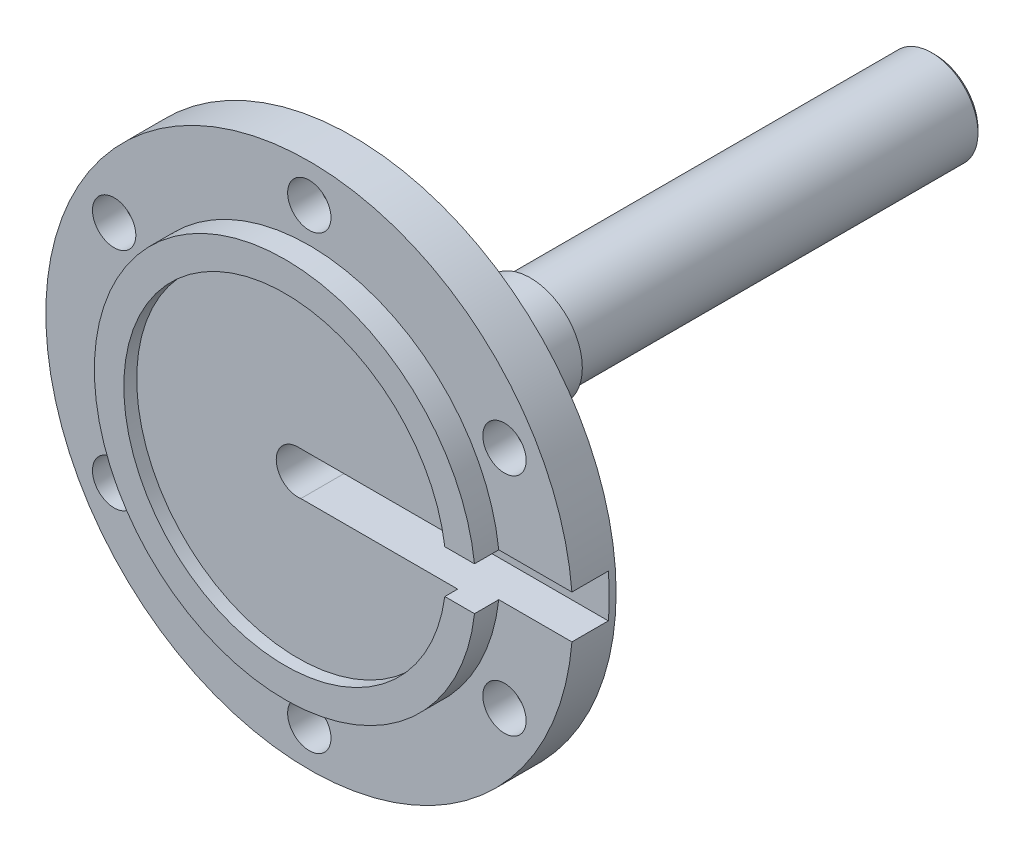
ISO-10303-21;
HEADER;
FILE_DESCRIPTION(('STEP AP214'),'2;1');
FILE_NAME('part.step','',(''),(''),'','','');
FILE_SCHEMA(('AUTOMOTIVE_DESIGN { 1 0 10303 214 1 1 1 1 }'));
ENDSEC;
DATA;
#1=APPLICATION_CONTEXT('core data for automotive mechanical design processes');
#2=APPLICATION_PROTOCOL_DEFINITION('international standard','automotive_design',2000,#1);
#3=PRODUCT_CONTEXT('',#1,'mechanical');
#4=PRODUCT('Part','Part','',(#3));
#5=PRODUCT_RELATED_PRODUCT_CATEGORY('part','',(#4));
#6=PRODUCT_DEFINITION_FORMATION('','',#4);
#7=PRODUCT_DEFINITION_CONTEXT('part definition',#1,'design');
#8=PRODUCT_DEFINITION('design','',#6,#7);
#9=PRODUCT_DEFINITION_SHAPE('','',#8);
#10=(LENGTH_UNIT() NAMED_UNIT(*) SI_UNIT(.MILLI.,.METRE.));
#11=(NAMED_UNIT(*) PLANE_ANGLE_UNIT() SI_UNIT($,.RADIAN.));
#12=(NAMED_UNIT(*) SI_UNIT($,.STERADIAN.) SOLID_ANGLE_UNIT());
#13=UNCERTAINTY_MEASURE_WITH_UNIT(LENGTH_MEASURE(1.E-05),#10,'distance_accuracy_value','');
#14=(GEOMETRIC_REPRESENTATION_CONTEXT(3) GLOBAL_UNCERTAINTY_ASSIGNED_CONTEXT((#13)) GLOBAL_UNIT_ASSIGNED_CONTEXT((#10,
#11,#12)) REPRESENTATION_CONTEXT('',''));
#15=CARTESIAN_POINT('',(0.,0.,0.));
#16=DIRECTION('',(0.,0.,1.));
#17=DIRECTION('',(1.,0.,0.));
#18=AXIS2_PLACEMENT_3D('',#15,#16,#17);
#19=CARTESIAN_POINT('',(0.,0.,6.41744805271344));
#20=DIRECTION('',(0.,0.,1.));
#21=DIRECTION('',(1.,0.,0.));
#22=AXIS2_PLACEMENT_3D('',#19,#20,#21);
#23=CYLINDRICAL_SURFACE('',#22,2.5);
#24=CARTESIAN_POINT('',(0.,0.,-75.));
#25=DIRECTION('',(0.,0.,1.));
#26=DIRECTION('',(1.,0.,0.));
#27=AXIS2_PLACEMENT_3D('',#24,#25,#26);
#28=CIRCLE('',#27,2.5);
#29=CARTESIAN_POINT('',(2.5,0.,-75.));
#30=VERTEX_POINT('',#29);
#31=EDGE_CURVE('E474',#30,#30,#28,.T.);
#32=ORIENTED_EDGE('',*,*,#31,.F.);
#33=EDGE_LOOP('',(#32));
#34=FACE_BOUND('',#33,.T.);
#35=DIRECTION('',(0.,0.,1.));
#36=VECTOR('',#35,1.);
#37=CARTESIAN_POINT('',(0.,2.5,-7.));
#38=LINE('',#37,#36);
#39=CARTESIAN_POINT('',(0.,2.5,-7.));
#40=VERTEX_POINT('',#39);
#41=CARTESIAN_POINT('',(0.,2.5,-1.48606199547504));
#42=VERTEX_POINT('',#41);
#43=EDGE_CURVE('E427',#40,#42,#38,.T.);
#44=ORIENTED_EDGE('',*,*,#43,.T.);
#45=CARTESIAN_POINT('',(0.,0.,-1.48606199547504));
#46=DIRECTION('',(0.,0.,1.));
#47=DIRECTION('',(1.,0.,0.));
#48=AXIS2_PLACEMENT_3D('',#45,#46,#47);
#49=CIRCLE('',#48,2.5);
#50=CARTESIAN_POINT('',(0.338064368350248,-2.47703703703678,-1.48606199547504));
#51=VERTEX_POINT('',#50);
#52=EDGE_CURVE('E477',#42,#51,#49,.T.);
#53=ORIENTED_EDGE('',*,*,#52,.T.);
#54=DIRECTION('',(0.,0.,1.));
#55=VECTOR('',#54,1.);
#56=CARTESIAN_POINT('',(0.338064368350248,-2.47703703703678,6.41744805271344));
#57=LINE('',#56,#55);
#58=CARTESIAN_POINT('',(0.338064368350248,-2.47703703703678,-7.));
#59=VERTEX_POINT('',#58);
#60=EDGE_CURVE('E439',#51,#59,#57,.F.);
#61=ORIENTED_EDGE('',*,*,#60,.T.);
#62=CARTESIAN_POINT('',(0.,0.,-7.));
#63=DIRECTION('',(0.,0.,1.));
#64=DIRECTION('',(1.,0.,0.));
#65=AXIS2_PLACEMENT_3D('',#62,#63,#64);
#66=CIRCLE('',#65,2.5);
#67=EDGE_CURVE('E422',#40,#59,#66,.F.);
#68=ORIENTED_EDGE('',*,*,#67,.F.);
#69=EDGE_LOOP('',(#44,#53,#61,#68));
#70=FACE_BOUND('',#69,.T.);
#71=ADVANCED_FACE('F353',(#34,#70),#23,.F.);
#72=CARTESIAN_POINT('',(0.,0.,6.41744805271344));
#73=DIRECTION('',(0.,0.,1.));
#74=DIRECTION('',(1.,0.,0.));
#75=AXIS2_PLACEMENT_3D('',#72,#73,#74);
#76=CYLINDRICAL_SURFACE('',#75,22.);
#77=CARTESIAN_POINT('',(0.,0.,0.));
#78=DIRECTION('',(0.,0.,1.));
#79=DIRECTION('',(1.,0.,0.));
#80=AXIS2_PLACEMENT_3D('',#77,#78,#79);
#81=CIRCLE('',#80,22.);
#82=CARTESIAN_POINT('',(21.8574929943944,2.5,0.));
#83=VERTEX_POINT('',#82);
#84=CARTESIAN_POINT('',(21.8601072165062,-2.47703703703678,0.));
#85=VERTEX_POINT('',#84);
#86=EDGE_CURVE('E485',#83,#85,#81,.T.);
#87=ORIENTED_EDGE('',*,*,#86,.F.);
#88=DIRECTION('',(0.,0.,1.));
#89=VECTOR('',#88,1.);
#90=CARTESIAN_POINT('',(21.8574929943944,2.5,6.41744805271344));
#91=LINE('',#90,#89);
#92=CARTESIAN_POINT('',(21.8574929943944,2.5,-2.8));
#93=VERTEX_POINT('',#92);
#94=EDGE_CURVE('E552',#83,#93,#91,.F.);
#95=ORIENTED_EDGE('',*,*,#94,.T.);
#96=CARTESIAN_POINT('',(0.,0.,-2.8));
#97=DIRECTION('',(0.,0.,1.));
#98=DIRECTION('',(1.,0.,0.));
#99=AXIS2_PLACEMENT_3D('',#96,#97,#98);
#100=CIRCLE('',#99,22.);
#101=CARTESIAN_POINT('',(21.8601072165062,-2.47703703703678,-2.8));
#102=VERTEX_POINT('',#101);
#103=EDGE_CURVE('E440',#93,#102,#100,.T.);
#104=ORIENTED_EDGE('',*,*,#103,.T.);
#105=DIRECTION('',(0.,0.,1.));
#106=VECTOR('',#105,1.);
#107=CARTESIAN_POINT('',(21.8601072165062,-2.47703703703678,6.41744805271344));
#108=LINE('',#107,#106);
#109=EDGE_CURVE('E368',#102,#85,#108,.T.);
#110=ORIENTED_EDGE('',*,*,#109,.T.);
#111=EDGE_LOOP('',(#87,#95,#104,#110));
#112=FACE_BOUND('',#111,.T.);
#113=ADVANCED_FACE('F355',(#112),#76,.T.);
#114=CARTESIAN_POINT('',(0.,22.,0.));
#115=DIRECTION('',(0.,0.,-1.));
#116=DIRECTION('',(-1.,0.,0.));
#117=AXIS2_PLACEMENT_3D('',#114,#115,#116);
#118=PLANE('',#117);
#119=CARTESIAN_POINT('',(0.,0.,0.));
#120=DIRECTION('',(0.,0.,1.));
#121=DIRECTION('',(1.,0.,0.));
#122=AXIS2_PLACEMENT_3D('',#119,#120,#121);
#123=CIRCLE('',#122,18.6);
#124=CARTESIAN_POINT('',(18.4312235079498,2.5,0.));
#125=VERTEX_POINT('',#124);
#126=CARTESIAN_POINT('',(18.4343236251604,-2.47703703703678,0.));
#127=VERTEX_POINT('',#126);
#128=EDGE_CURVE('E482',#125,#127,#123,.T.);
#129=ORIENTED_EDGE('',*,*,#128,.F.);
#130=DIRECTION('',(-1.,0.,0.));
#131=VECTOR('',#130,1.);
#132=CARTESIAN_POINT('',(0.,2.5,0.));
#133=LINE('',#132,#131);
#134=EDGE_CURVE('E544',#83,#125,#133,.T.);
#135=ORIENTED_EDGE('',*,*,#134,.F.);
#136=ORIENTED_EDGE('',*,*,#86,.T.);
#137=DIRECTION('',(1.,0.,0.));
#138=VECTOR('',#137,1.);
#139=CARTESIAN_POINT('',(0.,-2.47703703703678,0.));
#140=LINE('',#139,#138);
#141=EDGE_CURVE('E546',#127,#85,#140,.T.);
#142=ORIENTED_EDGE('',*,*,#141,.F.);
#143=EDGE_LOOP('',(#129,#135,#136,#142));
#144=FACE_BOUND('',#143,.T.);
#145=ADVANCED_FACE('F523',(#144),#118,.F.);
#146=CARTESIAN_POINT('',(0.,0.,6.41744805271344));
#147=DIRECTION('',(0.,0.,1.));
#148=DIRECTION('',(1.,0.,0.));
#149=AXIS2_PLACEMENT_3D('',#146,#147,#148);
#150=CYLINDRICAL_SURFACE('',#149,18.6);
#151=CARTESIAN_POINT('',(0.,0.,-1.48606199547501));
#152=DIRECTION('',(0.,0.,1.));
#153=DIRECTION('',(1.,0.,0.));
#154=AXIS2_PLACEMENT_3D('',#151,#152,#153);
#155=CIRCLE('',#154,18.6);
#156=CARTESIAN_POINT('',(18.4312235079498,2.5,-1.48606199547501));
#157=VERTEX_POINT('',#156);
#158=CARTESIAN_POINT('',(18.4343236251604,-2.47703703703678,-1.48606199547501));
#159=VERTEX_POINT('',#158);
#160=EDGE_CURVE('E479',#157,#159,#155,.T.);
#161=ORIENTED_EDGE('',*,*,#160,.F.);
#162=DIRECTION('',(0.,0.,1.));
#163=VECTOR('',#162,1.);
#164=CARTESIAN_POINT('',(18.4312235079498,2.5,6.41744805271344));
#165=LINE('',#164,#163);
#166=EDGE_CURVE('E376',#157,#125,#165,.T.);
#167=ORIENTED_EDGE('',*,*,#166,.T.);
#168=ORIENTED_EDGE('',*,*,#128,.T.);
#169=DIRECTION('',(0.,0.,1.));
#170=VECTOR('',#169,1.);
#171=CARTESIAN_POINT('',(18.4343236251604,-2.47703703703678,6.41744805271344));
#172=LINE('',#171,#170);
#173=EDGE_CURVE('E549',#127,#159,#172,.F.);
#174=ORIENTED_EDGE('',*,*,#173,.T.);
#175=EDGE_LOOP('',(#161,#167,#168,#174));
#176=FACE_BOUND('',#175,.T.);
#177=ADVANCED_FACE('F533',(#176),#150,.F.);
#178=CARTESIAN_POINT('',(0.,18.6,-1.48606199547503));
#179=DIRECTION('',(0.,0.,-1.));
#180=DIRECTION('',(-1.,0.,0.));
#181=AXIS2_PLACEMENT_3D('',#178,#179,#180);
#182=PLANE('',#181);
#183=ORIENTED_EDGE('',*,*,#52,.F.);
#184=DIRECTION('',(1.,0.,0.));
#185=VECTOR('',#184,1.);
#186=CARTESIAN_POINT('',(0.,2.5,-1.48606199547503));
#187=LINE('',#186,#185);
#188=EDGE_CURVE('E432',#42,#157,#187,.T.);
#189=ORIENTED_EDGE('',*,*,#188,.T.);
#190=ORIENTED_EDGE('',*,*,#160,.T.);
#191=DIRECTION('',(-1.,0.,0.));
#192=VECTOR('',#191,1.);
#193=CARTESIAN_POINT('',(0.,-2.47703703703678,-1.48606199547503));
#194=LINE('',#193,#192);
#195=EDGE_CURVE('E551',#159,#51,#194,.T.);
#196=ORIENTED_EDGE('',*,*,#195,.T.);
#197=EDGE_LOOP('',(#183,#189,#190,#196));
#198=FACE_BOUND('',#197,.T.);
#199=ADVANCED_FACE('F530',(#198),#182,.F.);
#200=CARTESIAN_POINT('',(0.,5.35,-75.));
#201=DIRECTION('',(0.,0.,1.));
#202=DIRECTION('',(1.,0.,0.));
#203=AXIS2_PLACEMENT_3D('',#200,#201,#202);
#204=PLANE('',#203);
#205=CARTESIAN_POINT('',(0.,0.,-75.));
#206=DIRECTION('',(0.,0.,1.));
#207=DIRECTION('',(1.,0.,0.));
#208=AXIS2_PLACEMENT_3D('',#205,#206,#207);
#209=CIRCLE('',#208,4.95000000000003);
#210=CARTESIAN_POINT('',(4.95000000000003,0.,-75.));
#211=VERTEX_POINT('',#210);
#212=EDGE_CURVE('E11',#211,#211,#209,.F.);
#213=ORIENTED_EDGE('',*,*,#212,.T.);
#214=EDGE_LOOP('',(#213));
#215=FACE_BOUND('',#214,.T.);
#216=ORIENTED_EDGE('',*,*,#31,.T.);
#217=EDGE_LOOP('',(#216));
#218=FACE_BOUND('',#217,.T.);
#219=ADVANCED_FACE('F528',(#215,#218),#204,.F.);
#220=CARTESIAN_POINT('',(0.,0.,6.41744805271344));
#221=DIRECTION('',(0.,0.,1.));
#222=DIRECTION('',(1.,0.,0.));
#223=AXIS2_PLACEMENT_3D('',#220,#221,#222);
#224=CYLINDRICAL_SURFACE('',#223,5.35);
#225=CARTESIAN_POINT('',(0.,0.,-74.6));
#226=DIRECTION('',(0.,0.,1.));
#227=DIRECTION('',(1.,0.,0.));
#228=AXIS2_PLACEMENT_3D('',#225,#226,#227);
#229=CIRCLE('',#228,5.35);
#230=CARTESIAN_POINT('',(5.35,0.,-74.6));
#231=VERTEX_POINT('',#230);
#232=EDGE_CURVE('E361',#231,#231,#229,.T.);
#233=ORIENTED_EDGE('',*,*,#232,.T.);
#234=EDGE_LOOP('',(#233));
#235=FACE_BOUND('',#234,.T.);
#236=CARTESIAN_POINT('',(0.,0.,-28.3));
#237=DIRECTION('',(0.,0.,1.));
#238=DIRECTION('',(1.,0.,0.));
#239=AXIS2_PLACEMENT_3D('',#236,#237,#238);
#240=CIRCLE('',#239,5.35);
#241=CARTESIAN_POINT('',(5.35,0.,-28.3));
#242=VERTEX_POINT('',#241);
#243=EDGE_CURVE('E471',#242,#242,#240,.T.);
#244=ORIENTED_EDGE('',*,*,#243,.F.);
#245=EDGE_LOOP('',(#244));
#246=FACE_BOUND('',#245,.T.);
#247=ADVANCED_FACE('F496',(#235,#246),#224,.T.);
#248=CARTESIAN_POINT('',(0.,6.,-28.3));
#249=DIRECTION('',(0.,0.,1.));
#250=DIRECTION('',(1.,0.,0.));
#251=AXIS2_PLACEMENT_3D('',#248,#249,#250);
#252=PLANE('',#251);
#253=CARTESIAN_POINT('',(0.,0.,-28.3));
#254=DIRECTION('',(0.,0.,1.));
#255=DIRECTION('',(1.,0.,0.));
#256=AXIS2_PLACEMENT_3D('',#253,#254,#255);
#257=CIRCLE('',#256,6.);
#258=CARTESIAN_POINT('',(6.,0.,-28.3));
#259=VERTEX_POINT('',#258);
#260=EDGE_CURVE('E468',#259,#259,#257,.T.);
#261=ORIENTED_EDGE('',*,*,#260,.F.);
#262=EDGE_LOOP('',(#261));
#263=FACE_BOUND('',#262,.T.);
#264=ORIENTED_EDGE('',*,*,#243,.T.);
#265=EDGE_LOOP('',(#264));
#266=FACE_BOUND('',#265,.T.);
#267=ADVANCED_FACE('F677',(#263,#266),#252,.F.);
#268=CARTESIAN_POINT('',(0.,0.,6.41744805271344));
#269=DIRECTION('',(0.,0.,1.));
#270=DIRECTION('',(1.,0.,0.));
#271=AXIS2_PLACEMENT_3D('',#268,#269,#270);
#272=CYLINDRICAL_SURFACE('',#271,6.);
#273=CARTESIAN_POINT('',(0.,0.,-20.5));
#274=DIRECTION('',(0.,0.,1.));
#275=DIRECTION('',(1.,0.,0.));
#276=AXIS2_PLACEMENT_3D('',#273,#274,#275);
#277=CIRCLE('',#276,6.);
#278=CARTESIAN_POINT('',(6.,0.,-20.5));
#279=VERTEX_POINT('',#278);
#280=EDGE_CURVE('E465',#279,#279,#277,.T.);
#281=ORIENTED_EDGE('',*,*,#280,.F.);
#282=EDGE_LOOP('',(#281));
#283=FACE_BOUND('',#282,.T.);
#284=ORIENTED_EDGE('',*,*,#260,.T.);
#285=EDGE_LOOP('',(#284));
#286=FACE_BOUND('',#285,.T.);
#287=ADVANCED_FACE('F671',(#283,#286),#272,.T.);
#288=CARTESIAN_POINT('',(0.,9.,-20.5));
#289=DIRECTION('',(0.,0.,1.));
#290=DIRECTION('',(1.,0.,0.));
#291=AXIS2_PLACEMENT_3D('',#288,#289,#290);
#292=PLANE('',#291);
#293=CARTESIAN_POINT('',(0.,0.,-20.5));
#294=DIRECTION('',(0.,0.,1.));
#295=DIRECTION('',(1.,0.,0.));
#296=AXIS2_PLACEMENT_3D('',#293,#294,#295);
#297=CIRCLE('',#296,9.);
#298=CARTESIAN_POINT('',(9.,0.,-20.5));
#299=VERTEX_POINT('',#298);
#300=EDGE_CURVE('E462',#299,#299,#297,.T.);
#301=ORIENTED_EDGE('',*,*,#300,.F.);
#302=EDGE_LOOP('',(#301));
#303=FACE_BOUND('',#302,.T.);
#304=ORIENTED_EDGE('',*,*,#280,.T.);
#305=EDGE_LOOP('',(#304));
#306=FACE_BOUND('',#305,.T.);
#307=ADVANCED_FACE('F665',(#303,#306),#292,.F.);
#308=CARTESIAN_POINT('',(0.,0.,6.41744805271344));
#309=DIRECTION('',(0.,0.,1.));
#310=DIRECTION('',(1.,0.,0.));
#311=AXIS2_PLACEMENT_3D('',#308,#309,#310);
#312=CYLINDRICAL_SURFACE('',#311,9.);
#313=CARTESIAN_POINT('',(0.,0.,-10.5));
#314=DIRECTION('',(0.,0.,1.));
#315=DIRECTION('',(1.,0.,0.));
#316=AXIS2_PLACEMENT_3D('',#313,#314,#315);
#317=CIRCLE('',#316,9.);
#318=CARTESIAN_POINT('',(9.,0.,-10.5));
#319=VERTEX_POINT('',#318);
#320=EDGE_CURVE('E459',#319,#319,#317,.T.);
#321=ORIENTED_EDGE('',*,*,#320,.F.);
#322=EDGE_LOOP('',(#321));
#323=FACE_BOUND('',#322,.T.);
#324=ORIENTED_EDGE('',*,*,#300,.T.);
#325=EDGE_LOOP('',(#324));
#326=FACE_BOUND('',#325,.T.);
#327=ADVANCED_FACE('F659',(#323,#326),#312,.T.);
#328=CARTESIAN_POINT('',(0.,11.4,-10.5));
#329=DIRECTION('',(0.,0.,1.));
#330=DIRECTION('',(1.,0.,0.));
#331=AXIS2_PLACEMENT_3D('',#328,#329,#330);
#332=PLANE('',#331);
#333=CARTESIAN_POINT('',(0.,0.,-10.5));
#334=DIRECTION('',(0.,0.,1.));
#335=DIRECTION('',(1.,0.,0.));
#336=AXIS2_PLACEMENT_3D('',#333,#334,#335);
#337=CIRCLE('',#336,11.4);
#338=CARTESIAN_POINT('',(11.4,0.,-10.5));
#339=VERTEX_POINT('',#338);
#340=EDGE_CURVE('E456',#339,#339,#337,.T.);
#341=ORIENTED_EDGE('',*,*,#340,.F.);
#342=EDGE_LOOP('',(#341));
#343=FACE_BOUND('',#342,.T.);
#344=ORIENTED_EDGE('',*,*,#320,.T.);
#345=EDGE_LOOP('',(#344));
#346=FACE_BOUND('',#345,.T.);
#347=ADVANCED_FACE('F653',(#343,#346),#332,.F.);
#348=CARTESIAN_POINT('',(0.,0.,6.41744805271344));
#349=DIRECTION('',(0.,0.,1.));
#350=DIRECTION('',(1.,0.,0.));
#351=AXIS2_PLACEMENT_3D('',#348,#349,#350);
#352=CYLINDRICAL_SURFACE('',#351,11.4);
#353=CARTESIAN_POINT('',(0.,0.,-7.8));
#354=DIRECTION('',(0.,0.,1.));
#355=DIRECTION('',(1.,0.,0.));
#356=AXIS2_PLACEMENT_3D('',#353,#354,#355);
#357=CIRCLE('',#356,11.4);
#358=CARTESIAN_POINT('',(11.4,0.,-7.8));
#359=VERTEX_POINT('',#358);
#360=EDGE_CURVE('E453',#359,#359,#357,.T.);
#361=ORIENTED_EDGE('',*,*,#360,.F.);
#362=EDGE_LOOP('',(#361));
#363=FACE_BOUND('',#362,.T.);
#364=ORIENTED_EDGE('',*,*,#340,.T.);
#365=EDGE_LOOP('',(#364));
#366=FACE_BOUND('',#365,.T.);
#367=ADVANCED_FACE('F636',(#363,#366),#352,.T.);
#368=CARTESIAN_POINT('',(0.,30.4,-7.8));
#369=DIRECTION('',(0.,0.,1.));
#370=DIRECTION('',(1.,0.,0.));
#371=AXIS2_PLACEMENT_3D('',#368,#369,#370);
#372=PLANE('',#371);
#373=CARTESIAN_POINT('',(-22.5166604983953,13.0000000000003,-7.8));
#374=DIRECTION('',(0.,0.,-1.));
#375=DIRECTION('',(-0.50000000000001,-0.866025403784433,0.));
#376=AXIS2_PLACEMENT_3D('',#373,#374,#375);
#377=CIRCLE('',#376,4.);
#378=CARTESIAN_POINT('',(-24.5166604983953,9.53589838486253,-7.8));
#379=VERTEX_POINT('',#378);
#380=EDGE_CURVE('E615',#379,#379,#377,.T.);
#381=ORIENTED_EDGE('',*,*,#380,.F.);
#382=EDGE_LOOP('',(#381));
#383=FACE_BOUND('',#382,.T.);
#384=CARTESIAN_POINT('',(-22.5166604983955,-12.9999999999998,-7.8));
#385=DIRECTION('',(0.,0.,-1.));
#386=DIRECTION('',(0.499999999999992,-0.866025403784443,0.));
#387=AXIS2_PLACEMENT_3D('',#384,#385,#386);
#388=CIRCLE('',#387,4.);
#389=CARTESIAN_POINT('',(-20.5166604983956,-16.4641016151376,-7.8));
#390=VERTEX_POINT('',#389);
#391=EDGE_CURVE('E609',#390,#390,#388,.T.);
#392=ORIENTED_EDGE('',*,*,#391,.F.);
#393=EDGE_LOOP('',(#392));
#394=FACE_BOUND('',#393,.T.);
#395=CARTESIAN_POINT('',(-1.81557134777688E-13,-26.,-7.8));
#396=DIRECTION('',(0.,0.,-1.));
#397=DIRECTION('',(1.,0.,0.));
#398=AXIS2_PLACEMENT_3D('',#395,#396,#397);
#399=CIRCLE('',#398,4.);
#400=CARTESIAN_POINT('',(3.99999999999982,-26.,-7.8));
#401=VERTEX_POINT('',#400);
#402=EDGE_CURVE('E603',#401,#401,#399,.T.);
#403=ORIENTED_EDGE('',*,*,#402,.F.);
#404=EDGE_LOOP('',(#403));
#405=FACE_BOUND('',#404,.T.);
#406=CARTESIAN_POINT('',(22.5166604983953,-13.0000000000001,-7.8));
#407=DIRECTION('',(0.,0.,-1.));
#408=DIRECTION('',(0.500000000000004,0.866025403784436,0.));
#409=AXIS2_PLACEMENT_3D('',#406,#407,#408);
#410=CIRCLE('',#409,4.);
#411=CARTESIAN_POINT('',(24.5166604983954,-9.53589838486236,-7.8));
#412=VERTEX_POINT('',#411);
#413=EDGE_CURVE('E597',#412,#412,#410,.T.);
#414=ORIENTED_EDGE('',*,*,#413,.F.);
#415=EDGE_LOOP('',(#414));
#416=FACE_BOUND('',#415,.T.);
#417=CARTESIAN_POINT('',(22.5166604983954,12.9999999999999,-7.8));
#418=DIRECTION('',(0.,0.,-1.));
#419=DIRECTION('',(-0.499999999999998,0.86602540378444,0.));
#420=AXIS2_PLACEMENT_3D('',#417,#418,#419);
#421=CIRCLE('',#420,4.);
#422=CARTESIAN_POINT('',(20.5166604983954,16.4641016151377,-7.8));
#423=VERTEX_POINT('',#422);
#424=EDGE_CURVE('E591',#423,#423,#421,.T.);
#425=ORIENTED_EDGE('',*,*,#424,.F.);
#426=EDGE_LOOP('',(#425));
#427=FACE_BOUND('',#426,.T.);
#428=CARTESIAN_POINT('',(0.,26.,-7.8));
#429=DIRECTION('',(0.,0.,-1.));
#430=DIRECTION('',(-1.,0.,0.));
#431=AXIS2_PLACEMENT_3D('',#428,#429,#430);
#432=CIRCLE('',#431,4.);
#433=CARTESIAN_POINT('',(-4.,26.,-7.8));
#434=VERTEX_POINT('',#433);
#435=EDGE_CURVE('E570',#434,#434,#432,.T.);
#436=ORIENTED_EDGE('',*,*,#435,.F.);
#437=EDGE_LOOP('',(#436));
#438=FACE_BOUND('',#437,.T.);
#439=CARTESIAN_POINT('',(0.,0.,-7.8));
#440=DIRECTION('',(0.,0.,1.));
#441=DIRECTION('',(1.,0.,0.));
#442=AXIS2_PLACEMENT_3D('',#439,#440,#441);
#443=CIRCLE('',#442,30.4);
#444=CARTESIAN_POINT('',(30.4,0.,-7.8));
#445=VERTEX_POINT('',#444);
#446=EDGE_CURVE('E450',#445,#445,#443,.T.);
#447=ORIENTED_EDGE('',*,*,#446,.F.);
#448=EDGE_LOOP('',(#447));
#449=FACE_BOUND('',#448,.T.);
#450=ORIENTED_EDGE('',*,*,#360,.T.);
#451=EDGE_LOOP('',(#450));
#452=FACE_BOUND('',#451,.T.);
#453=ADVANCED_FACE('F632',(#383,#394,#405,#416,#427,#438,#449,#452),#372,.F.);
#454=CARTESIAN_POINT('',(0.,0.,6.41744805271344));
#455=DIRECTION('',(0.,0.,1.));
#456=DIRECTION('',(1.,0.,0.));
#457=AXIS2_PLACEMENT_3D('',#454,#455,#456);
#458=CYLINDRICAL_SURFACE('',#457,30.4);
#459=CARTESIAN_POINT('',(0.,0.,-2.8));
#460=DIRECTION('',(0.,0.,1.));
#461=DIRECTION('',(1.,0.,0.));
#462=AXIS2_PLACEMENT_3D('',#459,#460,#461);
#463=CIRCLE('',#462,30.4);
#464=CARTESIAN_POINT('',(30.2970295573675,2.5,-2.8));
#465=VERTEX_POINT('',#464);
#466=CARTESIAN_POINT('',(30.2989156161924,-2.47703703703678,-2.8));
#467=VERTEX_POINT('',#466);
#468=EDGE_CURVE('E443',#465,#467,#463,.T.);
#469=ORIENTED_EDGE('',*,*,#468,.F.);
#470=DIRECTION('',(0.,0.,1.));
#471=VECTOR('',#470,1.);
#472=CARTESIAN_POINT('',(30.2970295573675,2.5,6.41744805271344));
#473=LINE('',#472,#471);
#474=CARTESIAN_POINT('',(30.2970295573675,2.5,-7.));
#475=VERTEX_POINT('',#474);
#476=EDGE_CURVE('E554',#465,#475,#473,.F.);
#477=ORIENTED_EDGE('',*,*,#476,.T.);
#478=CARTESIAN_POINT('',(0.,0.,-7.));
#479=DIRECTION('',(0.,0.,1.));
#480=DIRECTION('',(1.,0.,0.));
#481=AXIS2_PLACEMENT_3D('',#478,#479,#480);
#482=CIRCLE('',#481,30.4);
#483=CARTESIAN_POINT('',(30.2989156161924,-2.47703703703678,-7.));
#484=VERTEX_POINT('',#483);
#485=EDGE_CURVE('E425',#484,#475,#482,.T.);
#486=ORIENTED_EDGE('',*,*,#485,.F.);
#487=DIRECTION('',(0.,0.,1.));
#488=VECTOR('',#487,1.);
#489=CARTESIAN_POINT('',(30.2989156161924,-2.47703703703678,6.41744805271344));
#490=LINE('',#489,#488);
#491=EDGE_CURVE('E436',#484,#467,#490,.T.);
#492=ORIENTED_EDGE('',*,*,#491,.T.);
#493=EDGE_LOOP('',(#469,#477,#486,#492));
#494=FACE_BOUND('',#493,.T.);
#495=ORIENTED_EDGE('',*,*,#446,.T.);
#496=EDGE_LOOP('',(#495));
#497=FACE_BOUND('',#496,.T.);
#498=ADVANCED_FACE('F635',(#494,#497),#458,.T.);
#499=CARTESIAN_POINT('',(0.,22.,-2.8));
#500=DIRECTION('',(0.,0.,-1.));
#501=DIRECTION('',(-1.,0.,0.));
#502=AXIS2_PLACEMENT_3D('',#499,#500,#501);
#503=PLANE('',#502);
#504=CARTESIAN_POINT('',(-22.5166604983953,13.0000000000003,-2.8));
#505=DIRECTION('',(0.,0.,1.));
#506=DIRECTION('',(0.50000000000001,0.866025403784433,0.));
#507=AXIS2_PLACEMENT_3D('',#504,#505,#506);
#508=CIRCLE('',#507,2.5);
#509=CARTESIAN_POINT('',(-21.2666604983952,15.1650635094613,-2.8));
#510=VERTEX_POINT('',#509);
#511=EDGE_CURVE('E588',#510,#510,#508,.T.);
#512=ORIENTED_EDGE('',*,*,#511,.F.);
#513=EDGE_LOOP('',(#512));
#514=FACE_BOUND('',#513,.T.);
#515=CARTESIAN_POINT('',(-22.5166604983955,-12.9999999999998,-2.8));
#516=DIRECTION('',(0.,0.,1.));
#517=DIRECTION('',(-0.499999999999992,0.866025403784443,0.));
#518=AXIS2_PLACEMENT_3D('',#515,#516,#517);
#519=CIRCLE('',#518,2.5);
#520=CARTESIAN_POINT('',(-23.7666604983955,-10.8349364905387,-2.8));
#521=VERTEX_POINT('',#520);
#522=EDGE_CURVE('E585',#521,#521,#519,.T.);
#523=ORIENTED_EDGE('',*,*,#522,.F.);
#524=EDGE_LOOP('',(#523));
#525=FACE_BOUND('',#524,.T.);
#526=CARTESIAN_POINT('',(-1.81557134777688E-13,-26.,-2.8));
#527=DIRECTION('',(0.,0.,1.));
#528=DIRECTION('',(-1.,0.,0.));
#529=AXIS2_PLACEMENT_3D('',#526,#527,#528);
#530=CIRCLE('',#529,2.5);
#531=CARTESIAN_POINT('',(-2.50000000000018,-26.,-2.8));
#532=VERTEX_POINT('',#531);
#533=EDGE_CURVE('E582',#532,#532,#530,.T.);
#534=ORIENTED_EDGE('',*,*,#533,.F.);
#535=EDGE_LOOP('',(#534));
#536=FACE_BOUND('',#535,.T.);
#537=CARTESIAN_POINT('',(22.5166604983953,-13.0000000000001,-2.8));
#538=DIRECTION('',(0.,0.,1.));
#539=DIRECTION('',(-0.500000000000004,-0.866025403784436,0.));
#540=AXIS2_PLACEMENT_3D('',#537,#538,#539);
#541=CIRCLE('',#540,2.5);
#542=CARTESIAN_POINT('',(21.2666604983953,-15.1650635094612,-2.8));
#543=VERTEX_POINT('',#542);
#544=EDGE_CURVE('E579',#543,#543,#541,.T.);
#545=ORIENTED_EDGE('',*,*,#544,.F.);
#546=EDGE_LOOP('',(#545));
#547=FACE_BOUND('',#546,.T.);
#548=CARTESIAN_POINT('',(22.5166604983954,12.9999999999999,-2.8));
#549=DIRECTION('',(0.,0.,1.));
#550=DIRECTION('',(0.499999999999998,-0.86602540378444,0.));
#551=AXIS2_PLACEMENT_3D('',#548,#549,#550);
#552=CIRCLE('',#551,2.5);
#553=CARTESIAN_POINT('',(23.7666604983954,10.8349364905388,-2.8));
#554=VERTEX_POINT('',#553);
#555=EDGE_CURVE('E576',#554,#554,#552,.T.);
#556=ORIENTED_EDGE('',*,*,#555,.F.);
#557=EDGE_LOOP('',(#556));
#558=FACE_BOUND('',#557,.T.);
#559=CARTESIAN_POINT('',(0.,26.,-2.8));
#560=DIRECTION('',(0.,0.,1.));
#561=DIRECTION('',(1.,0.,0.));
#562=AXIS2_PLACEMENT_3D('',#559,#560,#561);
#563=CIRCLE('',#562,2.5);
#564=CARTESIAN_POINT('',(2.5,26.,-2.8));
#565=VERTEX_POINT('',#564);
#566=EDGE_CURVE('E567',#565,#565,#563,.T.);
#567=ORIENTED_EDGE('',*,*,#566,.F.);
#568=EDGE_LOOP('',(#567));
#569=FACE_BOUND('',#568,.T.);
#570=ORIENTED_EDGE('',*,*,#103,.F.);
#571=DIRECTION('',(1.,0.,0.));
#572=VECTOR('',#571,1.);
#573=CARTESIAN_POINT('',(0.,2.5,-2.8));
#574=LINE('',#573,#572);
#575=EDGE_CURVE('E490',#93,#465,#574,.T.);
#576=ORIENTED_EDGE('',*,*,#575,.T.);
#577=ORIENTED_EDGE('',*,*,#468,.T.);
#578=DIRECTION('',(-1.,0.,0.));
#579=VECTOR('',#578,1.);
#580=CARTESIAN_POINT('',(0.,-2.47703703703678,-2.8));
#581=LINE('',#580,#579);
#582=EDGE_CURVE('E488',#467,#102,#581,.T.);
#583=ORIENTED_EDGE('',*,*,#582,.T.);
#584=EDGE_LOOP('',(#570,#576,#577,#583));
#585=FACE_BOUND('',#584,.T.);
#586=ADVANCED_FACE('F692',(#514,#525,#536,#547,#558,#569,#585),#503,.F.);
#587=CARTESIAN_POINT('',(0.,-2.47703703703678,-7.));
#588=DIRECTION('',(0.,0.,1.));
#589=DIRECTION('',(1.,0.,0.));
#590=AXIS2_PLACEMENT_3D('',#587,#588,#589);
#591=PLANE('',#590);
#592=ORIENTED_EDGE('',*,*,#67,.T.);
#593=DIRECTION('',(1.,0.,0.));
#594=VECTOR('',#593,1.);
#595=CARTESIAN_POINT('',(0.,-2.47703703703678,-7.));
#596=LINE('',#595,#594);
#597=EDGE_CURVE('E428',#59,#484,#596,.T.);
#598=ORIENTED_EDGE('',*,*,#597,.T.);
#599=ORIENTED_EDGE('',*,*,#485,.T.);
#600=DIRECTION('',(-1.,0.,0.));
#601=VECTOR('',#600,1.);
#602=CARTESIAN_POINT('',(0.,2.5,-7.));
#603=LINE('',#602,#601);
#604=EDGE_CURVE('E417',#475,#40,#603,.T.);
#605=ORIENTED_EDGE('',*,*,#604,.T.);
#606=EDGE_LOOP('',(#592,#598,#599,#605));
#607=FACE_BOUND('',#606,.T.);
#608=ADVANCED_FACE('F419',(#607),#591,.T.);
#609=CARTESIAN_POINT('',(0.,2.5,-7.));
#610=DIRECTION('',(0.,1.,0.));
#611=DIRECTION('',(0.,0.,1.));
#612=AXIS2_PLACEMENT_3D('',#609,#610,#611);
#613=PLANE('',#612);
#614=ORIENTED_EDGE('',*,*,#188,.F.);
#615=ORIENTED_EDGE('',*,*,#43,.F.);
#616=ORIENTED_EDGE('',*,*,#604,.F.);
#617=ORIENTED_EDGE('',*,*,#476,.F.);
#618=ORIENTED_EDGE('',*,*,#575,.F.);
#619=ORIENTED_EDGE('',*,*,#94,.F.);
#620=ORIENTED_EDGE('',*,*,#134,.T.);
#621=ORIENTED_EDGE('',*,*,#166,.F.);
#622=EDGE_LOOP('',(#614,#615,#616,#617,#618,#619,#620,#621));
#623=FACE_BOUND('',#622,.T.);
#624=ADVANCED_FACE('F431',(#623),#613,.F.);
#625=CARTESIAN_POINT('',(0.,-2.47703703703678,-7.));
#626=DIRECTION('',(0.,-1.,0.));
#627=DIRECTION('',(0.,0.,-1.));
#628=AXIS2_PLACEMENT_3D('',#625,#626,#627);
#629=PLANE('',#628);
#630=ORIENTED_EDGE('',*,*,#141,.T.);
#631=ORIENTED_EDGE('',*,*,#109,.F.);
#632=ORIENTED_EDGE('',*,*,#582,.F.);
#633=ORIENTED_EDGE('',*,*,#491,.F.);
#634=ORIENTED_EDGE('',*,*,#597,.F.);
#635=ORIENTED_EDGE('',*,*,#60,.F.);
#636=ORIENTED_EDGE('',*,*,#195,.F.);
#637=ORIENTED_EDGE('',*,*,#173,.F.);
#638=EDGE_LOOP('',(#630,#631,#632,#633,#634,#635,#636,#637));
#639=FACE_BOUND('',#638,.T.);
#640=ADVANCED_FACE('F502',(#639),#629,.F.);
#641=CARTESIAN_POINT('',(0.,0.,-74.6));
#642=DIRECTION('',(0.,0.,1.));
#643=DIRECTION('',(1.,0.,0.));
#644=AXIS2_PLACEMENT_3D('',#641,#642,#643);
#645=CONICAL_SURFACE('',#644,5.35,0.785398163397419);
#646=ORIENTED_EDGE('',*,*,#212,.F.);
#647=EDGE_LOOP('',(#646));
#648=FACE_BOUND('',#647,.T.);
#649=ORIENTED_EDGE('',*,*,#232,.F.);
#650=EDGE_LOOP('',(#649));
#651=FACE_BOUND('',#650,.T.);
#652=ADVANCED_FACE('F499',(#648,#651),#645,.T.);
#653=CARTESIAN_POINT('',(0.,26.,-9.8));
#654=DIRECTION('',(0.,0.,1.));
#655=DIRECTION('',(1.,0.,0.));
#656=AXIS2_PLACEMENT_3D('',#653,#654,#655);
#657=CYLINDRICAL_SURFACE('',#656,2.5);
#658=CARTESIAN_POINT('',(0.,26.,-6.3));
#659=DIRECTION('',(0.,0.,-1.));
#660=DIRECTION('',(-1.,0.,0.));
#661=AXIS2_PLACEMENT_3D('',#658,#659,#660);
#662=CIRCLE('',#661,2.5);
#663=CARTESIAN_POINT('',(-2.5,26.,-6.3));
#664=VERTEX_POINT('',#663);
#665=EDGE_CURVE('E573',#664,#664,#662,.T.);
#666=ORIENTED_EDGE('',*,*,#665,.T.);
#667=EDGE_LOOP('',(#666));
#668=FACE_BOUND('',#667,.T.);
#669=ORIENTED_EDGE('',*,*,#566,.T.);
#670=EDGE_LOOP('',(#669));
#671=FACE_BOUND('',#670,.T.);
#672=ADVANCED_FACE('F501',(#668,#671),#657,.F.);
#673=CARTESIAN_POINT('',(0.,26.,-7.8));
#674=DIRECTION('',(0.,0.,-1.));
#675=DIRECTION('',(-1.,0.,0.));
#676=AXIS2_PLACEMENT_3D('',#673,#674,#675);
#677=CONICAL_SURFACE('',#676,4.,0.785398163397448);
#678=ORIENTED_EDGE('',*,*,#665,.F.);
#679=EDGE_LOOP('',(#678));
#680=FACE_BOUND('',#679,.T.);
#681=ORIENTED_EDGE('',*,*,#435,.T.);
#682=EDGE_LOOP('',(#681));
#683=FACE_BOUND('',#682,.T.);
#684=ADVANCED_FACE('F509',(#680,#683),#677,.F.);
#685=CARTESIAN_POINT('',(22.5166604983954,12.9999999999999,-9.8));
#686=DIRECTION('',(0.,0.,1.));
#687=DIRECTION('',(1.,0.,0.));
#688=AXIS2_PLACEMENT_3D('',#685,#686,#687);
#689=CYLINDRICAL_SURFACE('',#688,2.5);
#690=CARTESIAN_POINT('',(22.5166604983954,12.9999999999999,-6.3));
#691=DIRECTION('',(0.,0.,-1.));
#692=DIRECTION('',(-0.499999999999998,0.86602540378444,0.));
#693=AXIS2_PLACEMENT_3D('',#690,#691,#692);
#694=CIRCLE('',#693,2.5);
#695=CARTESIAN_POINT('',(21.2666604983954,15.165063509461,-6.3));
#696=VERTEX_POINT('',#695);
#697=EDGE_CURVE('E594',#696,#696,#694,.T.);
#698=ORIENTED_EDGE('',*,*,#697,.T.);
#699=EDGE_LOOP('',(#698));
#700=FACE_BOUND('',#699,.T.);
#701=ORIENTED_EDGE('',*,*,#555,.T.);
#702=EDGE_LOOP('',(#701));
#703=FACE_BOUND('',#702,.T.);
#704=ADVANCED_FACE('F761',(#700,#703),#689,.F.);
#705=CARTESIAN_POINT('',(22.5166604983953,-13.0000000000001,-9.8));
#706=DIRECTION('',(0.,0.,1.));
#707=DIRECTION('',(1.,0.,0.));
#708=AXIS2_PLACEMENT_3D('',#705,#706,#707);
#709=CYLINDRICAL_SURFACE('',#708,2.5);
#710=CARTESIAN_POINT('',(22.5166604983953,-13.0000000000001,-6.3));
#711=DIRECTION('',(0.,0.,-1.));
#712=DIRECTION('',(0.500000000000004,0.866025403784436,0.));
#713=AXIS2_PLACEMENT_3D('',#710,#711,#712);
#714=CIRCLE('',#713,2.5);
#715=CARTESIAN_POINT('',(23.7666604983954,-10.834936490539,-6.3));
#716=VERTEX_POINT('',#715);
#717=EDGE_CURVE('E600',#716,#716,#714,.T.);
#718=ORIENTED_EDGE('',*,*,#717,.T.);
#719=EDGE_LOOP('',(#718));
#720=FACE_BOUND('',#719,.T.);
#721=ORIENTED_EDGE('',*,*,#544,.T.);
#722=EDGE_LOOP('',(#721));
#723=FACE_BOUND('',#722,.T.);
#724=ADVANCED_FACE('F765',(#720,#723),#709,.F.);
#725=CARTESIAN_POINT('',(-1.81557134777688E-13,-26.,-9.8));
#726=DIRECTION('',(0.,0.,1.));
#727=DIRECTION('',(1.,0.,0.));
#728=AXIS2_PLACEMENT_3D('',#725,#726,#727);
#729=CYLINDRICAL_SURFACE('',#728,2.5);
#730=CARTESIAN_POINT('',(-1.81557134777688E-13,-26.,-6.3));
#731=DIRECTION('',(0.,0.,-1.));
#732=DIRECTION('',(1.,0.,0.));
#733=AXIS2_PLACEMENT_3D('',#730,#731,#732);
#734=CIRCLE('',#733,2.5);
#735=CARTESIAN_POINT('',(2.49999999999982,-26.,-6.3));
#736=VERTEX_POINT('',#735);
#737=EDGE_CURVE('E606',#736,#736,#734,.T.);
#738=ORIENTED_EDGE('',*,*,#737,.T.);
#739=EDGE_LOOP('',(#738));
#740=FACE_BOUND('',#739,.T.);
#741=ORIENTED_EDGE('',*,*,#533,.T.);
#742=EDGE_LOOP('',(#741));
#743=FACE_BOUND('',#742,.T.);
#744=ADVANCED_FACE('F774',(#740,#743),#729,.F.);
#745=CARTESIAN_POINT('',(-22.5166604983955,-12.9999999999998,-9.8));
#746=DIRECTION('',(0.,0.,1.));
#747=DIRECTION('',(1.,0.,0.));
#748=AXIS2_PLACEMENT_3D('',#745,#746,#747);
#749=CYLINDRICAL_SURFACE('',#748,2.5);
#750=CARTESIAN_POINT('',(-22.5166604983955,-12.9999999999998,-6.3));
#751=DIRECTION('',(0.,0.,-1.));
#752=DIRECTION('',(0.499999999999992,-0.866025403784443,0.));
#753=AXIS2_PLACEMENT_3D('',#750,#751,#752);
#754=CIRCLE('',#753,2.5);
#755=CARTESIAN_POINT('',(-21.2666604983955,-15.1650635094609,-6.3));
#756=VERTEX_POINT('',#755);
#757=EDGE_CURVE('E612',#756,#756,#754,.T.);
#758=ORIENTED_EDGE('',*,*,#757,.T.);
#759=EDGE_LOOP('',(#758));
#760=FACE_BOUND('',#759,.T.);
#761=ORIENTED_EDGE('',*,*,#522,.T.);
#762=EDGE_LOOP('',(#761));
#763=FACE_BOUND('',#762,.T.);
#764=ADVANCED_FACE('F782',(#760,#763),#749,.F.);
#765=CARTESIAN_POINT('',(-22.5166604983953,13.0000000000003,-9.8));
#766=DIRECTION('',(0.,0.,1.));
#767=DIRECTION('',(1.,0.,0.));
#768=AXIS2_PLACEMENT_3D('',#765,#766,#767);
#769=CYLINDRICAL_SURFACE('',#768,2.5);
#770=CARTESIAN_POINT('',(-22.5166604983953,13.0000000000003,-6.3));
#771=DIRECTION('',(0.,0.,-1.));
#772=DIRECTION('',(-0.50000000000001,-0.866025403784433,0.));
#773=AXIS2_PLACEMENT_3D('',#770,#771,#772);
#774=CIRCLE('',#773,2.5);
#775=CARTESIAN_POINT('',(-23.7666604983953,10.8349364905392,-6.3));
#776=VERTEX_POINT('',#775);
#777=EDGE_CURVE('E618',#776,#776,#774,.T.);
#778=ORIENTED_EDGE('',*,*,#777,.T.);
#779=EDGE_LOOP('',(#778));
#780=FACE_BOUND('',#779,.T.);
#781=ORIENTED_EDGE('',*,*,#511,.T.);
#782=EDGE_LOOP('',(#781));
#783=FACE_BOUND('',#782,.T.);
#784=ADVANCED_FACE('F622',(#780,#783),#769,.F.);
#785=CARTESIAN_POINT('',(22.5166604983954,12.9999999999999,-7.8));
#786=DIRECTION('',(0.,0.,-1.));
#787=DIRECTION('',(-0.499999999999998,0.86602540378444,0.));
#788=AXIS2_PLACEMENT_3D('',#785,#786,#787);
#789=CONICAL_SURFACE('',#788,4.,0.785398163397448);
#790=ORIENTED_EDGE('',*,*,#697,.F.);
#791=EDGE_LOOP('',(#790));
#792=FACE_BOUND('',#791,.T.);
#793=ORIENTED_EDGE('',*,*,#424,.T.);
#794=EDGE_LOOP('',(#793));
#795=FACE_BOUND('',#794,.T.);
#796=ADVANCED_FACE('F797',(#792,#795),#789,.F.);
#797=CARTESIAN_POINT('',(22.5166604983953,-13.0000000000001,-7.8));
#798=DIRECTION('',(0.,0.,-1.));
#799=DIRECTION('',(0.500000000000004,0.866025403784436,0.));
#800=AXIS2_PLACEMENT_3D('',#797,#798,#799);
#801=CONICAL_SURFACE('',#800,4.,0.785398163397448);
#802=ORIENTED_EDGE('',*,*,#717,.F.);
#803=EDGE_LOOP('',(#802));
#804=FACE_BOUND('',#803,.T.);
#805=ORIENTED_EDGE('',*,*,#413,.T.);
#806=EDGE_LOOP('',(#805));
#807=FACE_BOUND('',#806,.T.);
#808=ADVANCED_FACE('F804',(#804,#807),#801,.F.);
#809=CARTESIAN_POINT('',(-1.81557134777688E-13,-26.,-7.8));
#810=DIRECTION('',(0.,0.,-1.));
#811=DIRECTION('',(1.,0.,0.));
#812=AXIS2_PLACEMENT_3D('',#809,#810,#811);
#813=CONICAL_SURFACE('',#812,4.,0.785398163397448);
#814=ORIENTED_EDGE('',*,*,#737,.F.);
#815=EDGE_LOOP('',(#814));
#816=FACE_BOUND('',#815,.T.);
#817=ORIENTED_EDGE('',*,*,#402,.T.);
#818=EDGE_LOOP('',(#817));
#819=FACE_BOUND('',#818,.T.);
#820=ADVANCED_FACE('F812',(#816,#819),#813,.F.);
#821=CARTESIAN_POINT('',(-22.5166604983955,-12.9999999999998,-7.8));
#822=DIRECTION('',(0.,0.,-1.));
#823=DIRECTION('',(0.499999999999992,-0.866025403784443,0.));
#824=AXIS2_PLACEMENT_3D('',#821,#822,#823);
#825=CONICAL_SURFACE('',#824,4.,0.785398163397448);
#826=ORIENTED_EDGE('',*,*,#757,.F.);
#827=EDGE_LOOP('',(#826));
#828=FACE_BOUND('',#827,.T.);
#829=ORIENTED_EDGE('',*,*,#391,.T.);
#830=EDGE_LOOP('',(#829));
#831=FACE_BOUND('',#830,.T.);
#832=ADVANCED_FACE('F628',(#828,#831),#825,.F.);
#833=CARTESIAN_POINT('',(-22.5166604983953,13.0000000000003,-7.8));
#834=DIRECTION('',(0.,0.,-1.));
#835=DIRECTION('',(-0.50000000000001,-0.866025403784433,0.));
#836=AXIS2_PLACEMENT_3D('',#833,#834,#835);
#837=CONICAL_SURFACE('',#836,4.,0.785398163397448);
#838=ORIENTED_EDGE('',*,*,#777,.F.);
#839=EDGE_LOOP('',(#838));
#840=FACE_BOUND('',#839,.T.);
#841=ORIENTED_EDGE('',*,*,#380,.T.);
#842=EDGE_LOOP('',(#841));
#843=FACE_BOUND('',#842,.T.);
#844=ADVANCED_FACE('F625',(#840,#843),#837,.F.);
#845=CLOSED_SHELL('',(#71,#113,#145,#177,#199,#219,#247,#267,#287,#307,#327,#347,#367,#453,#498,
#586,#608,#624,#640,#652,#672,#684,#704,#724,#744,#764,#784,#796,#808,#820,#832,#844));
#846=MANIFOLD_SOLID_BREP('B2',#845);
#847=ADVANCED_BREP_SHAPE_REPRESENTATION('',(#18,#846),#14);
#848=SHAPE_DEFINITION_REPRESENTATION(#9,#847);
ENDSEC;
END-ISO-10303-21;
